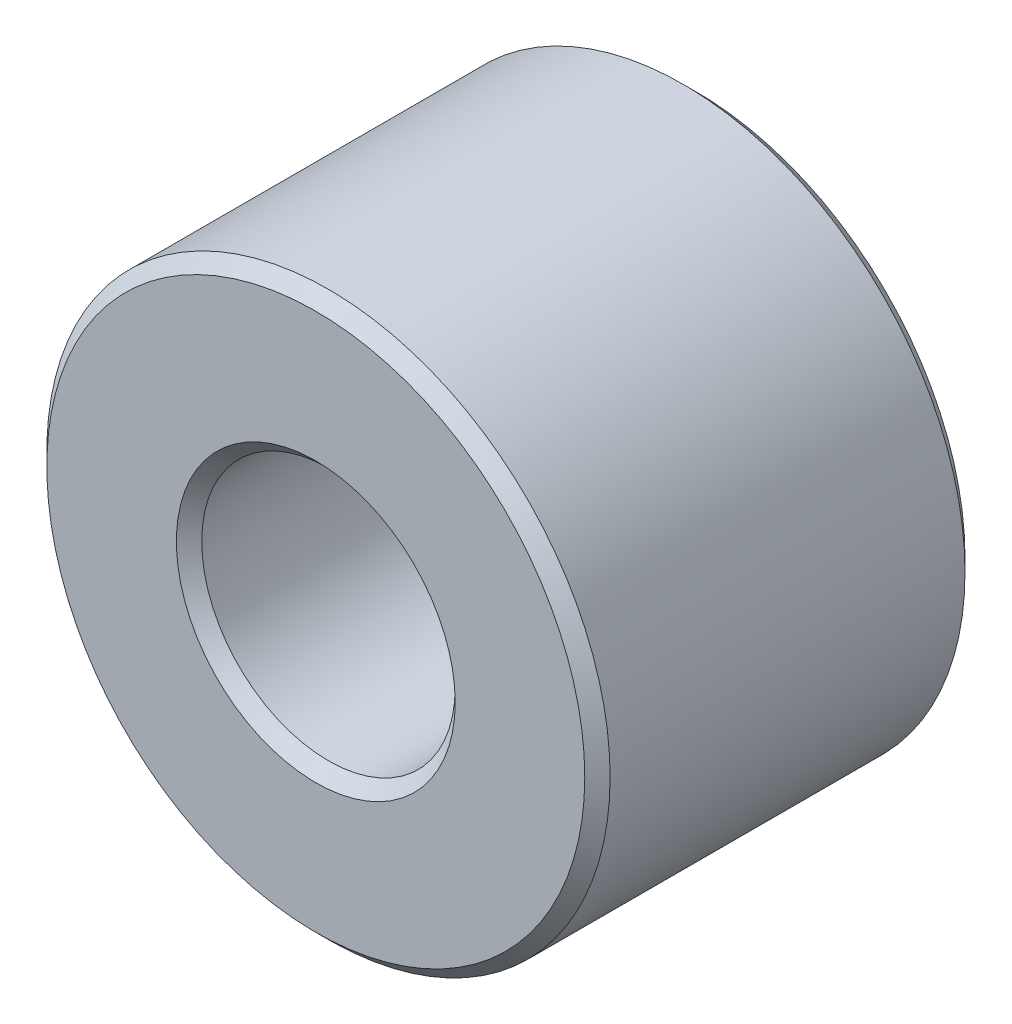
from build123d import *

# Parameters (mm, degrees)
SKETCH1_R           = 20
SKETCH1_R_2         = 9
BOSS_EXTRUDE1_DEPTH = 13.5
CHAMFER1_SIZE       = 0.9


with BuildPart() as part:
    # Sketch1 → Boss-Extrude1 (new, symmetric)
    with BuildSketch(Plane.XY):
        Circle(SKETCH1_R)
        Circle(SKETCH1_R_2, mode=Mode.SUBTRACT)
    extrude(amount=BOSS_EXTRUDE1_DEPTH, both=True)

    # Chamfer1
    chamfer1_edges = [part.edges().sort_by_distance(p)[0] for p in [
        (-20, 0, -13.5),
        (-20, 0, 13.5),
        (-9, 0, -13.5),
        (-9, 0, 13.5),
    ]]
    chamfer(chamfer1_edges, length=CHAMFER1_SIZE)


solid = part.part
